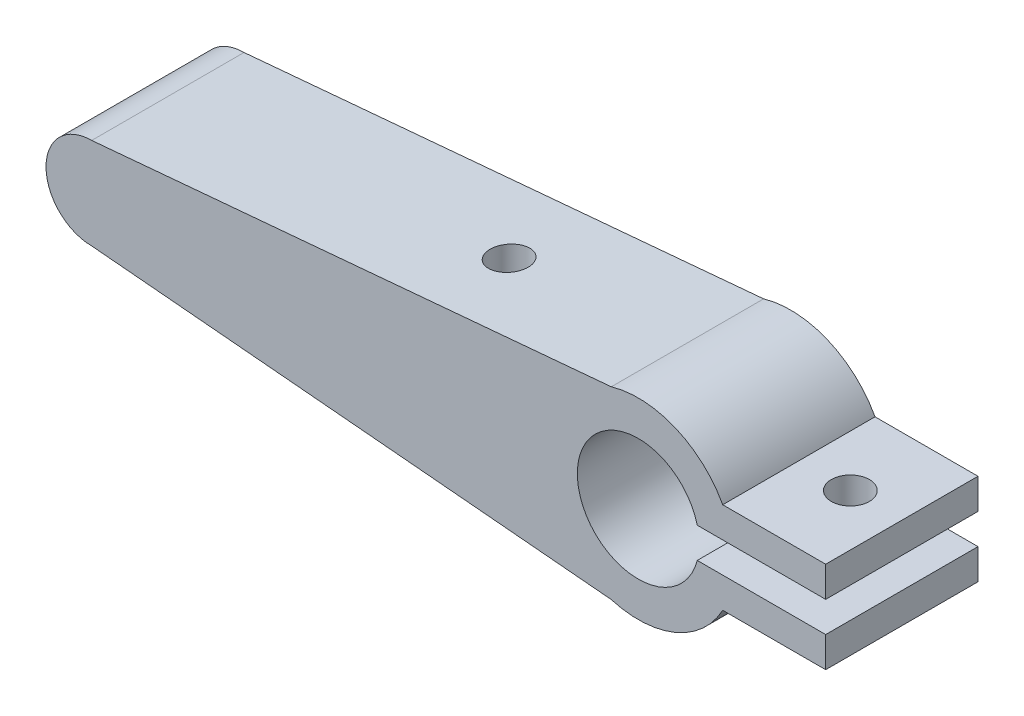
ISO-10303-21;
HEADER;
FILE_DESCRIPTION(('STEP AP214'),'2;1');
FILE_NAME('part.step','',(''),(''),'','','');
FILE_SCHEMA(('AUTOMOTIVE_DESIGN { 1 0 10303 214 1 1 1 1 }'));
ENDSEC;
DATA;
#1=APPLICATION_CONTEXT('core data for automotive mechanical design processes');
#2=APPLICATION_PROTOCOL_DEFINITION('international standard','automotive_design',2000,#1);
#3=PRODUCT_CONTEXT('',#1,'mechanical');
#4=PRODUCT('Part','Part','',(#3));
#5=PRODUCT_RELATED_PRODUCT_CATEGORY('part','',(#4));
#6=PRODUCT_DEFINITION_FORMATION('','',#4);
#7=PRODUCT_DEFINITION_CONTEXT('part definition',#1,'design');
#8=PRODUCT_DEFINITION('design','',#6,#7);
#9=PRODUCT_DEFINITION_SHAPE('','',#8);
#10=(LENGTH_UNIT() NAMED_UNIT(*) SI_UNIT(.MILLI.,.METRE.));
#11=(NAMED_UNIT(*) PLANE_ANGLE_UNIT() SI_UNIT($,.RADIAN.));
#12=(NAMED_UNIT(*) SI_UNIT($,.STERADIAN.) SOLID_ANGLE_UNIT());
#13=UNCERTAINTY_MEASURE_WITH_UNIT(LENGTH_MEASURE(1.E-05),#10,'distance_accuracy_value','');
#14=(GEOMETRIC_REPRESENTATION_CONTEXT(3) GLOBAL_UNCERTAINTY_ASSIGNED_CONTEXT((#13)) GLOBAL_UNIT_ASSIGNED_CONTEXT((#10,
#11,#12)) REPRESENTATION_CONTEXT('',''));
#15=CARTESIAN_POINT('',(0.,0.,0.));
#16=DIRECTION('',(0.,0.,1.));
#17=DIRECTION('',(1.,0.,0.));
#18=AXIS2_PLACEMENT_3D('',#15,#16,#17);
#19=CARTESIAN_POINT('',(-40.777557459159,-250.183734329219,10.));
#20=DIRECTION('',(0.0890663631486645,-0.99602569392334,0.));
#21=DIRECTION('',(0.99602569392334,0.0890663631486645,0.));
#22=AXIS2_PLACEMENT_3D('',#19,#20,#21);
#23=PLANE('',#22);
#24=DIRECTION('',(-0.99602569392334,-0.0890663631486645,0.));
#25=VECTOR('',#24,1.);
#26=CARTESIAN_POINT('',(-40.777557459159,-250.183734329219,0.));
#27=LINE('',#26,#25);
#28=CARTESIAN_POINT('',(-24.5409240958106,-248.731826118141,0.));
#29=VERTEX_POINT('',#28);
#30=CARTESIAN_POINT('',(-58.6526501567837,-251.782156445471,0.));
#31=VERTEX_POINT('',#30);
#32=EDGE_CURVE('E162',#29,#31,#27,.T.);
#33=ORIENTED_EDGE('',*,*,#32,.T.);
#34=DIRECTION('',(0.,0.,-1.));
#35=VECTOR('',#34,1.);
#36=CARTESIAN_POINT('',(-58.6526501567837,-251.782156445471,10.));
#37=LINE('',#36,#35);
#38=CARTESIAN_POINT('',(-58.6526501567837,-251.782156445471,10.));
#39=VERTEX_POINT('',#38);
#40=EDGE_CURVE('E202',#39,#31,#37,.T.);
#41=ORIENTED_EDGE('',*,*,#40,.F.);
#42=DIRECTION('',(-0.99602569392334,-0.0890663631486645,0.));
#43=VECTOR('',#42,1.);
#44=CARTESIAN_POINT('',(-40.777557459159,-250.183734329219,10.));
#45=LINE('',#44,#43);
#46=CARTESIAN_POINT('',(-24.5409240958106,-248.731826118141,10.));
#47=VERTEX_POINT('',#46);
#48=EDGE_CURVE('E226',#47,#39,#45,.T.);
#49=ORIENTED_EDGE('',*,*,#48,.F.);
#50=DIRECTION('',(0.,0.,-1.));
#51=VECTOR('',#50,1.);
#52=CARTESIAN_POINT('',(-24.5409240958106,-248.731826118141,10.));
#53=LINE('',#52,#51);
#54=EDGE_CURVE('E44',#47,#29,#53,.T.);
#55=ORIENTED_EDGE('',*,*,#54,.T.);
#56=EDGE_LOOP('',(#33,#41,#49,#55));
#57=FACE_BOUND('',#56,.T.);
#58=CARTESIAN_POINT('',(-36.2494029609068,-249.778818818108,5.));
#59=DIRECTION('',(0.0890663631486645,-0.99602569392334,0.));
#60=DIRECTION('',(0.99602569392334,0.0890663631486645,0.));
#61=AXIS2_PLACEMENT_3D('',#58,#59,#60);
#62=ELLIPSE('',#61,1.25498770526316,1.25);
#63=CARTESIAN_POINT('',(-34.9994029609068,-249.667041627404,5.));
#64=VERTEX_POINT('',#63);
#65=EDGE_CURVE('E215',#64,#64,#62,.F.);
#66=ORIENTED_EDGE('',*,*,#65,.F.);
#67=EDGE_LOOP('',(#66));
#68=FACE_BOUND('',#67,.T.);
#69=ADVANCED_FACE('F34',(#57,#68),#23,.F.);
#70=CARTESIAN_POINT('',(-33.329438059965,-260.0466024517,10.));
#71=DIRECTION('',(-0.0890663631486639,-0.99602569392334,0.));
#72=DIRECTION('',(0.99602569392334,-0.0890663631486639,0.));
#73=AXIS2_PLACEMENT_3D('',#70,#71,#72);
#74=PLANE('',#73);
#75=DIRECTION('',(-0.99602569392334,0.0890663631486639,0.));
#76=VECTOR('',#75,1.);
#77=CARTESIAN_POINT('',(-33.329438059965,-260.0466024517,0.));
#78=LINE('',#77,#76);
#79=CARTESIAN_POINT('',(-24.5409240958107,-260.832486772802,0.));
#80=VERTEX_POINT('',#79);
#81=CARTESIAN_POINT('',(-58.6526501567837,-257.782156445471,0.));
#82=VERTEX_POINT('',#81);
#83=EDGE_CURVE('E167',#80,#82,#78,.T.);
#84=ORIENTED_EDGE('',*,*,#83,.F.);
#85=DIRECTION('',(0.,0.,-1.));
#86=VECTOR('',#85,1.);
#87=CARTESIAN_POINT('',(-24.5409240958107,-260.832486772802,10.));
#88=LINE('',#87,#86);
#89=CARTESIAN_POINT('',(-24.5409240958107,-260.832486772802,10.));
#90=VERTEX_POINT('',#89);
#91=EDGE_CURVE('E198',#90,#80,#88,.T.);
#92=ORIENTED_EDGE('',*,*,#91,.F.);
#93=DIRECTION('',(-0.99602569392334,0.0890663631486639,0.));
#94=VECTOR('',#93,1.);
#95=CARTESIAN_POINT('',(-33.329438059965,-260.0466024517,10.));
#96=LINE('',#95,#94);
#97=CARTESIAN_POINT('',(-58.6526501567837,-257.782156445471,10.));
#98=VERTEX_POINT('',#97);
#99=EDGE_CURVE('E230',#90,#98,#96,.T.);
#100=ORIENTED_EDGE('',*,*,#99,.T.);
#101=DIRECTION('',(0.,0.,-1.));
#102=VECTOR('',#101,1.);
#103=CARTESIAN_POINT('',(-58.6526501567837,-257.782156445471,10.));
#104=LINE('',#103,#102);
#105=EDGE_CURVE('E200',#98,#82,#104,.T.);
#106=ORIENTED_EDGE('',*,*,#105,.T.);
#107=EDGE_LOOP('',(#84,#92,#100,#106));
#108=FACE_BOUND('',#107,.T.);
#109=CARTESIAN_POINT('',(-36.2494029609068,-259.785494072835,5.));
#110=DIRECTION('',(-0.0890663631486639,-0.99602569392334,0.));
#111=DIRECTION('',(-0.99602569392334,0.0890663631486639,0.));
#112=AXIS2_PLACEMENT_3D('',#109,#110,#111);
#113=ELLIPSE('',#112,1.25498770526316,1.25);
#114=CARTESIAN_POINT('',(-37.4994029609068,-259.673716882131,5.));
#115=VERTEX_POINT('',#114);
#116=EDGE_CURVE('E38',#115,#115,#113,.F.);
#117=ORIENTED_EDGE('',*,*,#116,.T.);
#118=EDGE_LOOP('',(#117));
#119=FACE_BOUND('',#118,.T.);
#120=ADVANCED_FACE('F262',(#108,#119),#74,.T.);
#121=CARTESIAN_POINT('',(-36.6125202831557,-251.782156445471,10.));
#122=DIRECTION('',(0.,-1.,0.));
#123=DIRECTION('',(0.,0.,-1.));
#124=AXIS2_PLACEMENT_3D('',#121,#122,#123);
#125=PLANE('',#124);
#126=CARTESIAN_POINT('',(-13.8461557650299,-251.782156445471,5.));
#127=DIRECTION('',(0.,-1.,0.));
#128=DIRECTION('',(0.,0.,-1.));
#129=AXIS2_PLACEMENT_3D('',#126,#127,#128);
#130=CIRCLE('',#129,1.25);
#131=CARTESIAN_POINT('',(-13.8461557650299,-251.782156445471,3.75));
#132=VERTEX_POINT('',#131);
#133=EDGE_CURVE('E160',#132,#132,#130,.T.);
#134=ORIENTED_EDGE('',*,*,#133,.T.);
#135=EDGE_LOOP('',(#134));
#136=FACE_BOUND('',#135,.T.);
#137=DIRECTION('',(-1.,0.,0.));
#138=VECTOR('',#137,1.);
#139=CARTESIAN_POINT('',(-36.6125202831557,-251.782156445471,0.));
#140=LINE('',#139,#138);
#141=CARTESIAN_POINT('',(-10.4663618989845,-251.782156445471,0.));
#142=VERTEX_POINT('',#141);
#143=CARTESIAN_POINT('',(-17.2259496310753,-251.782156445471,0.));
#144=VERTEX_POINT('',#143);
#145=EDGE_CURVE('E157',#142,#144,#140,.T.);
#146=ORIENTED_EDGE('',*,*,#145,.T.);
#147=DIRECTION('',(0.,0.,-1.));
#148=VECTOR('',#147,1.);
#149=CARTESIAN_POINT('',(-17.2259496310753,-251.782156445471,10.));
#150=LINE('',#149,#148);
#151=CARTESIAN_POINT('',(-17.2259496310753,-251.782156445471,10.));
#152=VERTEX_POINT('',#151);
#153=EDGE_CURVE('E11',#152,#144,#150,.T.);
#154=ORIENTED_EDGE('',*,*,#153,.F.);
#155=DIRECTION('',(-1.,0.,0.));
#156=VECTOR('',#155,1.);
#157=CARTESIAN_POINT('',(-36.6125202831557,-251.782156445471,10.));
#158=LINE('',#157,#156);
#159=CARTESIAN_POINT('',(-10.4663618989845,-251.782156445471,10.));
#160=VERTEX_POINT('',#159);
#161=EDGE_CURVE('E187',#160,#152,#158,.T.);
#162=ORIENTED_EDGE('',*,*,#161,.F.);
#163=DIRECTION('',(0.,0.,-1.));
#164=VECTOR('',#163,1.);
#165=CARTESIAN_POINT('',(-10.4663618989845,-251.782156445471,10.));
#166=LINE('',#165,#164);
#167=EDGE_CURVE('E53',#160,#142,#166,.T.);
#168=ORIENTED_EDGE('',*,*,#167,.T.);
#169=EDGE_LOOP('',(#146,#154,#162,#168));
#170=FACE_BOUND('',#169,.T.);
#171=ADVANCED_FACE('F36',(#136,#170),#125,.F.);
#172=CARTESIAN_POINT('',(-22.7704220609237,-254.782156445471,10.));
#173=DIRECTION('',(0.,0.,-1.));
#174=DIRECTION('',(-1.,0.,0.));
#175=AXIS2_PLACEMENT_3D('',#172,#173,#174);
#176=CYLINDRICAL_SURFACE('',#175,6.30406016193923);
#177=CARTESIAN_POINT('',(-22.7704220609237,-254.782156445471,0.));
#178=DIRECTION('',(0.,0.,1.));
#179=DIRECTION('',(1.,0.,0.));
#180=AXIS2_PLACEMENT_3D('',#177,#178,#179);
#181=CIRCLE('',#180,6.30406016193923);
#182=EDGE_CURVE('E159',#144,#29,#181,.T.);
#183=ORIENTED_EDGE('',*,*,#182,.T.);
#184=ORIENTED_EDGE('',*,*,#54,.F.);
#185=CARTESIAN_POINT('',(-22.7704220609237,-254.782156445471,10.));
#186=DIRECTION('',(0.,0.,1.));
#187=DIRECTION('',(1.,0.,0.));
#188=AXIS2_PLACEMENT_3D('',#185,#186,#187);
#189=CIRCLE('',#188,6.30406016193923);
#190=EDGE_CURVE('E103',#152,#47,#189,.T.);
#191=ORIENTED_EDGE('',*,*,#190,.F.);
#192=ORIENTED_EDGE('',*,*,#153,.T.);
#193=EDGE_LOOP('',(#183,#184,#191,#192));
#194=FACE_BOUND('',#193,.T.);
#195=ADVANCED_FACE('F273',(#194),#176,.T.);
#196=CARTESIAN_POINT('',(-58.6526501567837,-254.782156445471,10.));
#197=DIRECTION('',(0.,0.,-1.));
#198=DIRECTION('',(-1.,0.,0.));
#199=AXIS2_PLACEMENT_3D('',#196,#197,#198);
#200=CYLINDRICAL_SURFACE('',#199,3.);
#201=CARTESIAN_POINT('',(-58.6526501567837,-254.782156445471,0.));
#202=DIRECTION('',(0.,0.,1.));
#203=DIRECTION('',(1.,0.,0.));
#204=AXIS2_PLACEMENT_3D('',#201,#202,#203);
#205=CIRCLE('',#204,3.);
#206=EDGE_CURVE('E164',#31,#82,#205,.T.);
#207=ORIENTED_EDGE('',*,*,#206,.T.);
#208=ORIENTED_EDGE('',*,*,#105,.F.);
#209=CARTESIAN_POINT('',(-58.6526501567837,-254.782156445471,10.));
#210=DIRECTION('',(0.,0.,1.));
#211=DIRECTION('',(1.,0.,0.));
#212=AXIS2_PLACEMENT_3D('',#209,#210,#211);
#213=CIRCLE('',#212,3.);
#214=EDGE_CURVE('E228',#39,#98,#213,.T.);
#215=ORIENTED_EDGE('',*,*,#214,.F.);
#216=ORIENTED_EDGE('',*,*,#40,.T.);
#217=EDGE_LOOP('',(#207,#208,#215,#216));
#218=FACE_BOUND('',#217,.T.);
#219=ADVANCED_FACE('F272',(#218),#200,.T.);
#220=CARTESIAN_POINT('',(-22.7704220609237,-254.782156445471,10.));
#221=DIRECTION('',(0.,0.,-1.));
#222=DIRECTION('',(-1.,0.,0.));
#223=AXIS2_PLACEMENT_3D('',#220,#221,#222);
#224=CYLINDRICAL_SURFACE('',#223,6.30406016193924);
#225=CARTESIAN_POINT('',(-22.7704220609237,-254.782156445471,0.));
#226=DIRECTION('',(0.,0.,1.));
#227=DIRECTION('',(1.,0.,0.));
#228=AXIS2_PLACEMENT_3D('',#225,#226,#227);
#229=CIRCLE('',#228,6.30406016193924);
#230=CARTESIAN_POINT('',(-17.2259496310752,-257.782156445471,0.));
#231=VERTEX_POINT('',#230);
#232=EDGE_CURVE('E170',#80,#231,#229,.T.);
#233=ORIENTED_EDGE('',*,*,#232,.T.);
#234=DIRECTION('',(0.,0.,-1.));
#235=VECTOR('',#234,1.);
#236=CARTESIAN_POINT('',(-17.2259496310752,-257.782156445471,10.));
#237=LINE('',#236,#235);
#238=CARTESIAN_POINT('',(-17.2259496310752,-257.782156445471,10.));
#239=VERTEX_POINT('',#238);
#240=EDGE_CURVE('E196',#239,#231,#237,.T.);
#241=ORIENTED_EDGE('',*,*,#240,.F.);
#242=CARTESIAN_POINT('',(-22.7704220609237,-254.782156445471,10.));
#243=DIRECTION('',(0.,0.,1.));
#244=DIRECTION('',(1.,0.,0.));
#245=AXIS2_PLACEMENT_3D('',#242,#243,#244);
#246=CIRCLE('',#245,6.30406016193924);
#247=EDGE_CURVE('E233',#90,#239,#246,.T.);
#248=ORIENTED_EDGE('',*,*,#247,.F.);
#249=ORIENTED_EDGE('',*,*,#91,.T.);
#250=EDGE_LOOP('',(#233,#241,#248,#249));
#251=FACE_BOUND('',#250,.T.);
#252=ADVANCED_FACE('F279',(#251),#224,.T.);
#253=CARTESIAN_POINT('',(-36.6125202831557,-257.782156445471,10.));
#254=DIRECTION('',(0.,-1.,0.));
#255=DIRECTION('',(0.,0.,-1.));
#256=AXIS2_PLACEMENT_3D('',#253,#254,#255);
#257=PLANE('',#256);
#258=CARTESIAN_POINT('',(-13.8461557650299,-257.782156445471,5.));
#259=DIRECTION('',(0.,-1.,0.));
#260=DIRECTION('',(0.,0.,-1.));
#261=AXIS2_PLACEMENT_3D('',#258,#259,#260);
#262=CIRCLE('',#261,1.25);
#263=CARTESIAN_POINT('',(-13.8461557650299,-257.782156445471,3.75));
#264=VERTEX_POINT('',#263);
#265=EDGE_CURVE('E209',#264,#264,#262,.T.);
#266=ORIENTED_EDGE('',*,*,#265,.F.);
#267=EDGE_LOOP('',(#266));
#268=FACE_BOUND('',#267,.T.);
#269=DIRECTION('',(-1.,0.,0.));
#270=VECTOR('',#269,1.);
#271=CARTESIAN_POINT('',(-36.6125202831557,-257.782156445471,0.));
#272=LINE('',#271,#270);
#273=CARTESIAN_POINT('',(-10.4663618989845,-257.782156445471,0.));
#274=VERTEX_POINT('',#273);
#275=EDGE_CURVE('E173',#274,#231,#272,.T.);
#276=ORIENTED_EDGE('',*,*,#275,.F.);
#277=DIRECTION('',(0.,0.,-1.));
#278=VECTOR('',#277,1.);
#279=CARTESIAN_POINT('',(-10.4663618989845,-257.782156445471,10.));
#280=LINE('',#279,#278);
#281=CARTESIAN_POINT('',(-10.4663618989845,-257.782156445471,10.));
#282=VERTEX_POINT('',#281);
#283=EDGE_CURVE('E194',#282,#274,#280,.T.);
#284=ORIENTED_EDGE('',*,*,#283,.F.);
#285=DIRECTION('',(-1.,0.,0.));
#286=VECTOR('',#285,1.);
#287=CARTESIAN_POINT('',(-36.6125202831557,-257.782156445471,10.));
#288=LINE('',#287,#286);
#289=EDGE_CURVE('E235',#282,#239,#288,.T.);
#290=ORIENTED_EDGE('',*,*,#289,.T.);
#291=ORIENTED_EDGE('',*,*,#240,.T.);
#292=EDGE_LOOP('',(#276,#284,#290,#291));
#293=FACE_BOUND('',#292,.T.);
#294=ADVANCED_FACE('F298',(#268,#293),#257,.T.);
#295=CARTESIAN_POINT('',(-10.4663618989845,-296.761183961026,10.));
#296=DIRECTION('',(-1.,0.,0.));
#297=DIRECTION('',(0.,0.,1.));
#298=AXIS2_PLACEMENT_3D('',#295,#296,#297);
#299=PLANE('',#298);
#300=DIRECTION('',(0.,1.,0.));
#301=VECTOR('',#300,1.);
#302=CARTESIAN_POINT('',(-10.4663618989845,-296.761183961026,0.));
#303=LINE('',#302,#301);
#304=CARTESIAN_POINT('',(-10.4663618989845,-255.782156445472,0.));
#305=VERTEX_POINT('',#304);
#306=EDGE_CURVE('E176',#274,#305,#303,.T.);
#307=ORIENTED_EDGE('',*,*,#306,.T.);
#308=DIRECTION('',(0.,0.,-1.));
#309=VECTOR('',#308,1.);
#310=CARTESIAN_POINT('',(-10.4663618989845,-255.782156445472,10.));
#311=LINE('',#310,#309);
#312=CARTESIAN_POINT('',(-10.4663618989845,-255.782156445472,10.));
#313=VERTEX_POINT('',#312);
#314=EDGE_CURVE('E191',#313,#305,#311,.T.);
#315=ORIENTED_EDGE('',*,*,#314,.F.);
#316=DIRECTION('',(0.,1.,0.));
#317=VECTOR('',#316,1.);
#318=CARTESIAN_POINT('',(-10.4663618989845,-296.761183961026,10.));
#319=LINE('',#318,#317);
#320=EDGE_CURVE('E238',#282,#313,#319,.T.);
#321=ORIENTED_EDGE('',*,*,#320,.F.);
#322=ORIENTED_EDGE('',*,*,#283,.T.);
#323=EDGE_LOOP('',(#307,#315,#321,#322));
#324=FACE_BOUND('',#323,.T.);
#325=ADVANCED_FACE('F243',(#324),#299,.F.);
#326=CARTESIAN_POINT('',(-36.6125202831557,-255.782156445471,10.));
#327=DIRECTION('',(0.,-1.,0.));
#328=DIRECTION('',(0.,0.,-1.));
#329=AXIS2_PLACEMENT_3D('',#326,#327,#328);
#330=PLANE('',#329);
#331=CARTESIAN_POINT('',(-13.8461557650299,-255.782156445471,5.));
#332=DIRECTION('',(0.,-1.,0.));
#333=DIRECTION('',(0.,0.,-1.));
#334=AXIS2_PLACEMENT_3D('',#331,#332,#333);
#335=CIRCLE('',#334,1.25);
#336=CARTESIAN_POINT('',(-13.8461557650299,-255.782156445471,3.75));
#337=VERTEX_POINT('',#336);
#338=EDGE_CURVE('E208',#337,#337,#335,.T.);
#339=ORIENTED_EDGE('',*,*,#338,.T.);
#340=EDGE_LOOP('',(#339));
#341=FACE_BOUND('',#340,.T.);
#342=DIRECTION('',(-1.,0.,0.));
#343=VECTOR('',#342,1.);
#344=CARTESIAN_POINT('',(-36.6125202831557,-255.782156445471,0.));
#345=LINE('',#344,#343);
#346=CARTESIAN_POINT('',(-18.8974387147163,-255.782156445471,0.));
#347=VERTEX_POINT('',#346);
#348=EDGE_CURVE('E178',#305,#347,#345,.T.);
#349=ORIENTED_EDGE('',*,*,#348,.T.);
#350=DIRECTION('',(0.,0.,-1.));
#351=VECTOR('',#350,1.);
#352=CARTESIAN_POINT('',(-18.8974387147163,-255.782156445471,10.));
#353=LINE('',#352,#351);
#354=CARTESIAN_POINT('',(-18.8974387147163,-255.782156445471,10.));
#355=VERTEX_POINT('',#354);
#356=EDGE_CURVE('E140',#355,#347,#353,.T.);
#357=ORIENTED_EDGE('',*,*,#356,.F.);
#358=DIRECTION('',(-1.,0.,0.));
#359=VECTOR('',#358,1.);
#360=CARTESIAN_POINT('',(-36.6125202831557,-255.782156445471,10.));
#361=LINE('',#360,#359);
#362=EDGE_CURVE('E148',#313,#355,#361,.T.);
#363=ORIENTED_EDGE('',*,*,#362,.F.);
#364=ORIENTED_EDGE('',*,*,#314,.T.);
#365=EDGE_LOOP('',(#349,#357,#363,#364));
#366=FACE_BOUND('',#365,.T.);
#367=ADVANCED_FACE('F247',(#341,#366),#330,.F.);
#368=CARTESIAN_POINT('',(-22.7704220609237,-254.782156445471,10.));
#369=DIRECTION('',(0.,0.,-1.));
#370=DIRECTION('',(-1.,0.,0.));
#371=AXIS2_PLACEMENT_3D('',#368,#369,#370);
#372=CYLINDRICAL_SURFACE('',#371,3.99999999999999);
#373=CARTESIAN_POINT('',(-22.7704220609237,-254.782156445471,0.));
#374=DIRECTION('',(0.,0.,1.));
#375=DIRECTION('',(1.,0.,0.));
#376=AXIS2_PLACEMENT_3D('',#373,#374,#375);
#377=CIRCLE('',#376,3.99999999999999);
#378=CARTESIAN_POINT('',(-18.8974387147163,-253.782156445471,0.));
#379=VERTEX_POINT('',#378);
#380=EDGE_CURVE('E136',#379,#347,#377,.T.);
#381=ORIENTED_EDGE('',*,*,#380,.F.);
#382=DIRECTION('',(0.,0.,-1.));
#383=VECTOR('',#382,1.);
#384=CARTESIAN_POINT('',(-18.8974387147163,-253.782156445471,10.));
#385=LINE('',#384,#383);
#386=CARTESIAN_POINT('',(-18.8974387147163,-253.782156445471,10.));
#387=VERTEX_POINT('',#386);
#388=EDGE_CURVE('E131',#387,#379,#385,.T.);
#389=ORIENTED_EDGE('',*,*,#388,.F.);
#390=CARTESIAN_POINT('',(-22.7704220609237,-254.782156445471,10.));
#391=DIRECTION('',(0.,0.,1.));
#392=DIRECTION('',(1.,0.,0.));
#393=AXIS2_PLACEMENT_3D('',#390,#391,#392);
#394=CIRCLE('',#393,3.99999999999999);
#395=EDGE_CURVE('E134',#387,#355,#394,.T.);
#396=ORIENTED_EDGE('',*,*,#395,.T.);
#397=ORIENTED_EDGE('',*,*,#356,.T.);
#398=EDGE_LOOP('',(#381,#389,#396,#397));
#399=FACE_BOUND('',#398,.T.);
#400=ADVANCED_FACE('F133',(#399),#372,.F.);
#401=CARTESIAN_POINT('',(-36.6125202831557,-253.782156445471,10.));
#402=DIRECTION('',(0.,-1.,0.));
#403=DIRECTION('',(0.,0.,-1.));
#404=AXIS2_PLACEMENT_3D('',#401,#402,#403);
#405=PLANE('',#404);
#406=CARTESIAN_POINT('',(-13.8461557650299,-253.782156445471,5.));
#407=DIRECTION('',(0.,-1.,0.));
#408=DIRECTION('',(0.,0.,-1.));
#409=AXIS2_PLACEMENT_3D('',#406,#407,#408);
#410=CIRCLE('',#409,1.25);
#411=CARTESIAN_POINT('',(-13.8461557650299,-253.782156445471,3.75));
#412=VERTEX_POINT('',#411);
#413=EDGE_CURVE('E206',#412,#412,#410,.T.);
#414=ORIENTED_EDGE('',*,*,#413,.F.);
#415=EDGE_LOOP('',(#414));
#416=FACE_BOUND('',#415,.T.);
#417=DIRECTION('',(-1.,0.,0.));
#418=VECTOR('',#417,1.);
#419=CARTESIAN_POINT('',(-36.6125202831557,-253.782156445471,0.));
#420=LINE('',#419,#418);
#421=CARTESIAN_POINT('',(-10.4663618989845,-253.782156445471,0.));
#422=VERTEX_POINT('',#421);
#423=EDGE_CURVE('E182',#422,#379,#420,.T.);
#424=ORIENTED_EDGE('',*,*,#423,.F.);
#425=DIRECTION('',(0.,0.,-1.));
#426=VECTOR('',#425,1.);
#427=CARTESIAN_POINT('',(-10.4663618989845,-253.782156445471,10.));
#428=LINE('',#427,#426);
#429=CARTESIAN_POINT('',(-10.4663618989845,-253.782156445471,10.));
#430=VERTEX_POINT('',#429);
#431=EDGE_CURVE('E91',#430,#422,#428,.T.);
#432=ORIENTED_EDGE('',*,*,#431,.F.);
#433=DIRECTION('',(-1.,0.,0.));
#434=VECTOR('',#433,1.);
#435=CARTESIAN_POINT('',(-36.6125202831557,-253.782156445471,10.));
#436=LINE('',#435,#434);
#437=EDGE_CURVE('E146',#430,#387,#436,.T.);
#438=ORIENTED_EDGE('',*,*,#437,.T.);
#439=ORIENTED_EDGE('',*,*,#388,.T.);
#440=EDGE_LOOP('',(#424,#432,#438,#439));
#441=FACE_BOUND('',#440,.T.);
#442=ADVANCED_FACE('F151',(#416,#441),#405,.T.);
#443=CARTESIAN_POINT('',(-10.4663618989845,-296.761183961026,10.));
#444=DIRECTION('',(1.,0.,0.));
#445=DIRECTION('',(0.,0.,-1.));
#446=AXIS2_PLACEMENT_3D('',#443,#444,#445);
#447=PLANE('',#446);
#448=DIRECTION('',(0.,-1.,0.));
#449=VECTOR('',#448,1.);
#450=CARTESIAN_POINT('',(-10.4663618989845,-296.761183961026,0.));
#451=LINE('',#450,#449);
#452=EDGE_CURVE('E184',#142,#422,#451,.T.);
#453=ORIENTED_EDGE('',*,*,#452,.F.);
#454=ORIENTED_EDGE('',*,*,#167,.F.);
#455=DIRECTION('',(0.,-1.,0.));
#456=VECTOR('',#455,1.);
#457=CARTESIAN_POINT('',(-10.4663618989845,-296.761183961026,10.));
#458=LINE('',#457,#456);
#459=EDGE_CURVE('E152',#160,#430,#458,.T.);
#460=ORIENTED_EDGE('',*,*,#459,.T.);
#461=ORIENTED_EDGE('',*,*,#431,.T.);
#462=EDGE_LOOP('',(#453,#454,#460,#461));
#463=FACE_BOUND('',#462,.T.);
#464=ADVANCED_FACE('F250',(#463),#447,.T.);
#465=CARTESIAN_POINT('',(-36.6125202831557,-296.761183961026,10.));
#466=DIRECTION('',(0.,0.,1.));
#467=DIRECTION('',(1.,0.,0.));
#468=AXIS2_PLACEMENT_3D('',#465,#466,#467);
#469=PLANE('',#468);
#470=ORIENTED_EDGE('',*,*,#161,.T.);
#471=ORIENTED_EDGE('',*,*,#190,.T.);
#472=ORIENTED_EDGE('',*,*,#48,.T.);
#473=ORIENTED_EDGE('',*,*,#214,.T.);
#474=ORIENTED_EDGE('',*,*,#99,.F.);
#475=ORIENTED_EDGE('',*,*,#247,.T.);
#476=ORIENTED_EDGE('',*,*,#289,.F.);
#477=ORIENTED_EDGE('',*,*,#320,.T.);
#478=ORIENTED_EDGE('',*,*,#362,.T.);
#479=ORIENTED_EDGE('',*,*,#395,.F.);
#480=ORIENTED_EDGE('',*,*,#437,.F.);
#481=ORIENTED_EDGE('',*,*,#459,.F.);
#482=EDGE_LOOP('',(#470,#471,#472,#473,#474,#475,#476,#477,#478,#479,#480,#481));
#483=FACE_BOUND('',#482,.T.);
#484=ADVANCED_FACE('F144',(#483),#469,.T.);
#485=CARTESIAN_POINT('',(-36.6125202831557,-296.761183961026,0.));
#486=DIRECTION('',(0.,0.,1.));
#487=DIRECTION('',(1.,0.,0.));
#488=AXIS2_PLACEMENT_3D('',#485,#486,#487);
#489=PLANE('',#488);
#490=ORIENTED_EDGE('',*,*,#145,.F.);
#491=ORIENTED_EDGE('',*,*,#452,.T.);
#492=ORIENTED_EDGE('',*,*,#423,.T.);
#493=ORIENTED_EDGE('',*,*,#380,.T.);
#494=ORIENTED_EDGE('',*,*,#348,.F.);
#495=ORIENTED_EDGE('',*,*,#306,.F.);
#496=ORIENTED_EDGE('',*,*,#275,.T.);
#497=ORIENTED_EDGE('',*,*,#232,.F.);
#498=ORIENTED_EDGE('',*,*,#83,.T.);
#499=ORIENTED_EDGE('',*,*,#206,.F.);
#500=ORIENTED_EDGE('',*,*,#32,.F.);
#501=ORIENTED_EDGE('',*,*,#182,.F.);
#502=EDGE_LOOP('',(#490,#491,#492,#493,#494,#495,#496,#497,#498,#499,#500,#501));
#503=FACE_BOUND('',#502,.T.);
#504=ADVANCED_FACE('F249',(#503),#489,.F.);
#505=CARTESIAN_POINT('',(-13.8461557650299,-247.782156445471,5.));
#506=DIRECTION('',(0.,-1.,0.));
#507=DIRECTION('',(0.,0.,-1.));
#508=AXIS2_PLACEMENT_3D('',#505,#506,#507);
#509=CYLINDRICAL_SURFACE('',#508,1.25);
#510=ORIENTED_EDGE('',*,*,#413,.T.);
#511=EDGE_LOOP('',(#510));
#512=FACE_BOUND('',#511,.T.);
#513=ORIENTED_EDGE('',*,*,#133,.F.);
#514=EDGE_LOOP('',(#513));
#515=FACE_BOUND('',#514,.T.);
#516=ADVANCED_FACE('F330',(#512,#515),#509,.F.);
#517=ORIENTED_EDGE('',*,*,#265,.T.);
#518=EDGE_LOOP('',(#517));
#519=FACE_BOUND('',#518,.T.);
#520=ORIENTED_EDGE('',*,*,#338,.F.);
#521=EDGE_LOOP('',(#520));
#522=FACE_BOUND('',#521,.T.);
#523=ADVANCED_FACE('F335',(#519,#522),#509,.F.);
#524=CARTESIAN_POINT('',(-36.2494029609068,-277.782156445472,5.));
#525=DIRECTION('',(0.,1.,0.));
#526=DIRECTION('',(0.,0.,1.));
#527=AXIS2_PLACEMENT_3D('',#524,#525,#526);
#528=CYLINDRICAL_SURFACE('',#527,1.25);
#529=ORIENTED_EDGE('',*,*,#116,.F.);
#530=EDGE_LOOP('',(#529));
#531=FACE_BOUND('',#530,.T.);
#532=ORIENTED_EDGE('',*,*,#65,.T.);
#533=EDGE_LOOP('',(#532));
#534=FACE_BOUND('',#533,.T.);
#535=ADVANCED_FACE('F345',(#531,#534),#528,.F.);
#536=CLOSED_SHELL('',(#69,#120,#171,#195,#219,#252,#294,#325,#367,#400,#442,#464,#484,#504,#516,
#523,#535));
#537=MANIFOLD_SOLID_BREP('B2',#536);
#538=ADVANCED_BREP_SHAPE_REPRESENTATION('',(#18,#537),#14);
#539=SHAPE_DEFINITION_REPRESENTATION(#9,#538);
ENDSEC;
END-ISO-10303-21;
